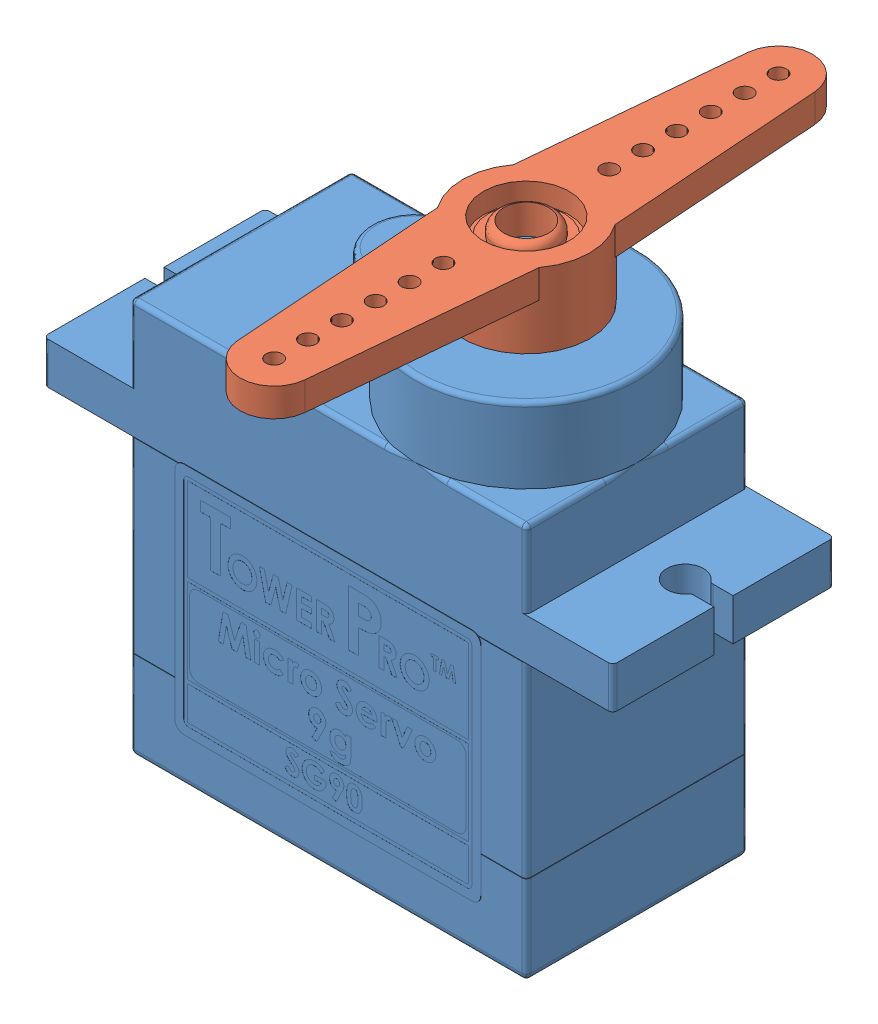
SolidWorks assembly SG90.SLDASM, configuration Default (file format 6000). Lengths in mm.
Overall size (32.36 31.5 32.31).
2 component instances, 2 part files, 2 mates.
Components (placement in the parent):
- SG90 BODY-1: SG90 BODY.SLDPRT [Default] at (9.9674 8.0019 -5.2145) size (32.36 29.6 12.65)
- SG90 ARM-1: SG90 ARM.SLDPRT [Default] at (3.6682 15.3806 1.0847) x (-0.011061 0 0.999939) z (-0.999939 0 -0.011061) size (32.23 4.23 7.24)
Mates (geometry in assembly coordinates):
- Concentric1: concentric aligned: cylinder of SG90 BODY-1 through (3.6682 51.1707 1.0847) axis (0 -1 0) radius 2.286; cylinder of SG90 ARM-1 through (3.6682 16.9935 1.0847) axis (0 -1 0) radius 3.6195
- Coincident1: coincident anti-aligned: plane of SG90 BODY-1 through (9.9674 15.1012 7.3839) normal (0 1 0); plane of SG90 ARM-1 through (3.6682 15.1012 1.0847) normal (0 -1 0)
